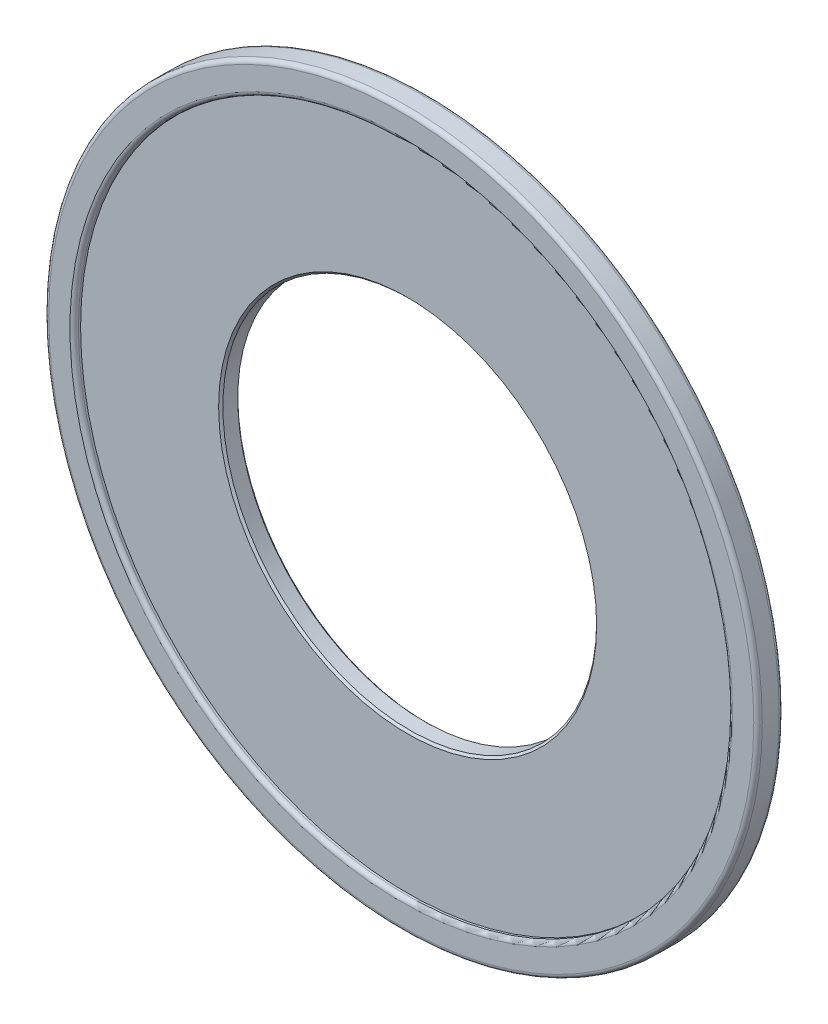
ISO-10303-21;
HEADER;
FILE_DESCRIPTION(('STEP AP214'),'2;1');
FILE_NAME('part.step','',(''),(''),'','','');
FILE_SCHEMA(('AUTOMOTIVE_DESIGN { 1 0 10303 214 1 1 1 1 }'));
ENDSEC;
DATA;
#1=APPLICATION_CONTEXT('core data for automotive mechanical design processes');
#2=APPLICATION_PROTOCOL_DEFINITION('international standard','automotive_design',2000,#1);
#3=PRODUCT_CONTEXT('',#1,'mechanical');
#4=PRODUCT('Part','Part','',(#3));
#5=PRODUCT_RELATED_PRODUCT_CATEGORY('part','',(#4));
#6=PRODUCT_DEFINITION_FORMATION('','',#4);
#7=PRODUCT_DEFINITION_CONTEXT('part definition',#1,'design');
#8=PRODUCT_DEFINITION('design','',#6,#7);
#9=PRODUCT_DEFINITION_SHAPE('','',#8);
#10=(LENGTH_UNIT() NAMED_UNIT(*) SI_UNIT(.MILLI.,.METRE.));
#11=(NAMED_UNIT(*) PLANE_ANGLE_UNIT() SI_UNIT($,.RADIAN.));
#12=(NAMED_UNIT(*) SI_UNIT($,.STERADIAN.) SOLID_ANGLE_UNIT());
#13=UNCERTAINTY_MEASURE_WITH_UNIT(LENGTH_MEASURE(1.E-05),#10,'distance_accuracy_value','');
#14=(GEOMETRIC_REPRESENTATION_CONTEXT(3) GLOBAL_UNCERTAINTY_ASSIGNED_CONTEXT((#13)) GLOBAL_UNIT_ASSIGNED_CONTEXT((#10,
#11,#12)) REPRESENTATION_CONTEXT('',''));
#15=CARTESIAN_POINT('',(0.,0.,0.));
#16=DIRECTION('',(0.,0.,1.));
#17=DIRECTION('',(1.,0.,0.));
#18=AXIS2_PLACEMENT_3D('',#15,#16,#17);
#19=CARTESIAN_POINT('',(0.,0.,6.));
#20=DIRECTION('',(0.,0.,-1.));
#21=DIRECTION('',(-1.,0.,0.));
#22=AXIS2_PLACEMENT_3D('',#19,#20,#21);
#23=CYLINDRICAL_SURFACE('',#22,44.);
#24=CARTESIAN_POINT('',(0.,0.,3.99999999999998));
#25=DIRECTION('',(0.,0.,1.));
#26=DIRECTION('',(1.,0.,0.));
#27=AXIS2_PLACEMENT_3D('',#24,#25,#26);
#28=CIRCLE('',#27,44.);
#29=CARTESIAN_POINT('',(44.,0.,3.99999999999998));
#30=VERTEX_POINT('',#29);
#31=EDGE_CURVE('E40',#30,#30,#28,.T.);
#32=ORIENTED_EDGE('',*,*,#31,.T.);
#33=EDGE_LOOP('',(#32));
#34=FACE_BOUND('',#33,.T.);
#35=CARTESIAN_POINT('',(0.,0.,0.49999999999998));
#36=DIRECTION('',(0.,0.,1.));
#37=DIRECTION('',(1.,0.,0.));
#38=AXIS2_PLACEMENT_3D('',#35,#36,#37);
#39=CIRCLE('',#38,44.);
#40=CARTESIAN_POINT('',(44.,0.,0.49999999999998));
#41=VERTEX_POINT('',#40);
#42=EDGE_CURVE('E44',#41,#41,#39,.F.);
#43=ORIENTED_EDGE('',*,*,#42,.T.);
#44=EDGE_LOOP('',(#43));
#45=FACE_BOUND('',#44,.T.);
#46=ADVANCED_FACE('F29',(#34,#45),#23,.F.);
#47=CARTESIAN_POINT('',(0.,0.,6.));
#48=DIRECTION('',(0.,0.,1.));
#49=DIRECTION('',(1.,0.,0.));
#50=AXIS2_PLACEMENT_3D('',#47,#48,#49);
#51=PLANE('',#50);
#52=CARTESIAN_POINT('',(0.,0.,6.));
#53=DIRECTION('',(0.,0.,1.));
#54=DIRECTION('',(1.,0.,0.));
#55=AXIS2_PLACEMENT_3D('',#52,#53,#54);
#56=CIRCLE('',#55,83.);
#57=CARTESIAN_POINT('',(83.,0.,6.));
#58=VERTEX_POINT('',#57);
#59=EDGE_CURVE('E52',#58,#58,#56,.T.);
#60=ORIENTED_EDGE('',*,*,#59,.T.);
#61=EDGE_LOOP('',(#60));
#62=FACE_BOUND('',#61,.T.);
#63=CARTESIAN_POINT('',(0.,0.,6.));
#64=DIRECTION('',(0.,0.,1.));
#65=DIRECTION('',(1.,0.,0.));
#66=AXIS2_PLACEMENT_3D('',#63,#64,#65);
#67=CIRCLE('',#66,78.);
#68=CARTESIAN_POINT('',(78.,0.,6.));
#69=VERTEX_POINT('',#68);
#70=EDGE_CURVE('E55',#69,#69,#67,.F.);
#71=ORIENTED_EDGE('',*,*,#70,.T.);
#72=EDGE_LOOP('',(#71));
#73=FACE_BOUND('',#72,.T.);
#74=ADVANCED_FACE('F89',(#62,#73),#51,.T.);
#75=CARTESIAN_POINT('',(0.,0.,0.));
#76=DIRECTION('',(0.,0.,1.));
#77=DIRECTION('',(1.,0.,0.));
#78=AXIS2_PLACEMENT_3D('',#75,#76,#77);
#79=PLANE('',#78);
#80=CARTESIAN_POINT('',(0.,0.,0.));
#81=DIRECTION('',(0.,0.,1.));
#82=DIRECTION('',(1.,0.,0.));
#83=AXIS2_PLACEMENT_3D('',#80,#81,#82);
#84=CIRCLE('',#83,44.5);
#85=CARTESIAN_POINT('',(44.5,0.,0.));
#86=VERTEX_POINT('',#85);
#87=EDGE_CURVE('E10',#86,#86,#84,.T.);
#88=ORIENTED_EDGE('',*,*,#87,.T.);
#89=EDGE_LOOP('',(#88));
#90=FACE_BOUND('',#89,.T.);
#91=CARTESIAN_POINT('',(0.,0.,0.));
#92=DIRECTION('',(0.,0.,1.));
#93=DIRECTION('',(1.,0.,0.));
#94=AXIS2_PLACEMENT_3D('',#91,#92,#93);
#95=CIRCLE('',#94,83.);
#96=CARTESIAN_POINT('',(83.,0.,0.));
#97=VERTEX_POINT('',#96);
#98=EDGE_CURVE('E58',#97,#97,#95,.F.);
#99=ORIENTED_EDGE('',*,*,#98,.T.);
#100=EDGE_LOOP('',(#99));
#101=FACE_BOUND('',#100,.T.);
#102=ADVANCED_FACE('F84',(#90,#101),#79,.F.);
#103=CARTESIAN_POINT('',(0.,0.,6.));
#104=DIRECTION('',(0.,0.,-1.));
#105=DIRECTION('',(-1.,0.,0.));
#106=AXIS2_PLACEMENT_3D('',#103,#104,#105);
#107=CYLINDRICAL_SURFACE('',#106,84.);
#108=CARTESIAN_POINT('',(0.,0.,1.));
#109=DIRECTION('',(0.,0.,1.));
#110=DIRECTION('',(1.,0.,0.));
#111=AXIS2_PLACEMENT_3D('',#108,#109,#110);
#112=CIRCLE('',#111,84.);
#113=CARTESIAN_POINT('',(84.,0.,1.));
#114=VERTEX_POINT('',#113);
#115=EDGE_CURVE('E61',#114,#114,#112,.T.);
#116=ORIENTED_EDGE('',*,*,#115,.T.);
#117=EDGE_LOOP('',(#116));
#118=FACE_BOUND('',#117,.T.);
#119=CARTESIAN_POINT('',(0.,0.,5.));
#120=DIRECTION('',(0.,0.,1.));
#121=DIRECTION('',(1.,0.,0.));
#122=AXIS2_PLACEMENT_3D('',#119,#120,#121);
#123=CIRCLE('',#122,84.);
#124=CARTESIAN_POINT('',(84.,0.,5.));
#125=VERTEX_POINT('',#124);
#126=EDGE_CURVE('E64',#125,#125,#123,.F.);
#127=ORIENTED_EDGE('',*,*,#126,.T.);
#128=EDGE_LOOP('',(#127));
#129=FACE_BOUND('',#128,.T.);
#130=ADVANCED_FACE('F75',(#118,#129),#107,.T.);
#131=CARTESIAN_POINT('',(0.,0.,4.5));
#132=DIRECTION('',(0.,0.,1.));
#133=DIRECTION('',(1.,0.,0.));
#134=AXIS2_PLACEMENT_3D('',#131,#132,#133);
#135=CYLINDRICAL_SURFACE('',#134,77.);
#136=CARTESIAN_POINT('',(0.,0.,5.));
#137=DIRECTION('',(0.,0.,1.));
#138=DIRECTION('',(1.,0.,0.));
#139=AXIS2_PLACEMENT_3D('',#136,#137,#138);
#140=CIRCLE('',#139,77.);
#141=CARTESIAN_POINT('',(77.,0.,5.));
#142=VERTEX_POINT('',#141);
#143=EDGE_CURVE('E49',#142,#142,#140,.T.);
#144=ORIENTED_EDGE('',*,*,#143,.T.);
#145=EDGE_LOOP('',(#144));
#146=FACE_BOUND('',#145,.T.);
#147=CARTESIAN_POINT('',(0.,0.,4.5));
#148=DIRECTION('',(0.,0.,1.));
#149=DIRECTION('',(1.,0.,0.));
#150=AXIS2_PLACEMENT_3D('',#147,#148,#149);
#151=CIRCLE('',#150,77.);
#152=CARTESIAN_POINT('',(77.,0.,4.5));
#153=VERTEX_POINT('',#152);
#154=EDGE_CURVE('E67',#153,#153,#151,.T.);
#155=ORIENTED_EDGE('',*,*,#154,.F.);
#156=EDGE_LOOP('',(#155));
#157=FACE_BOUND('',#156,.T.);
#158=ADVANCED_FACE('F73',(#146,#157),#135,.F.);
#159=CARTESIAN_POINT('',(0.,0.,4.5));
#160=DIRECTION('',(0.,0.,1.));
#161=DIRECTION('',(1.,0.,0.));
#162=AXIS2_PLACEMENT_3D('',#159,#160,#161);
#163=PLANE('',#162);
#164=CARTESIAN_POINT('',(0.,0.,4.5));
#165=DIRECTION('',(0.,0.,1.));
#166=DIRECTION('',(1.,0.,0.));
#167=AXIS2_PLACEMENT_3D('',#164,#165,#166);
#168=CIRCLE('',#167,44.5);
#169=CARTESIAN_POINT('',(44.5,0.,4.5));
#170=VERTEX_POINT('',#169);
#171=EDGE_CURVE('E36',#170,#170,#168,.F.);
#172=ORIENTED_EDGE('',*,*,#171,.T.);
#173=EDGE_LOOP('',(#172));
#174=FACE_BOUND('',#173,.T.);
#175=ORIENTED_EDGE('',*,*,#154,.T.);
#176=EDGE_LOOP('',(#175));
#177=FACE_BOUND('',#176,.T.);
#178=ADVANCED_FACE('F71',(#174,#177),#163,.T.);
#179=CARTESIAN_POINT('',(0.,0.,1.));
#180=DIRECTION('',(0.,0.,1.));
#181=DIRECTION('',(1.,0.,0.));
#182=AXIS2_PLACEMENT_3D('',#179,#180,#181);
#183=TOROIDAL_SURFACE('',#182,83.,1.);
#184=ORIENTED_EDGE('',*,*,#98,.F.);
#185=EDGE_LOOP('',(#184));
#186=FACE_BOUND('',#185,.T.);
#187=ORIENTED_EDGE('',*,*,#115,.F.);
#188=EDGE_LOOP('',(#187));
#189=FACE_BOUND('',#188,.T.);
#190=ADVANCED_FACE('F82',(#186,#189),#183,.T.);
#191=CARTESIAN_POINT('',(0.,0.,5.));
#192=DIRECTION('',(0.,0.,1.));
#193=DIRECTION('',(1.,0.,0.));
#194=AXIS2_PLACEMENT_3D('',#191,#192,#193);
#195=TOROIDAL_SURFACE('',#194,83.,1.);
#196=ORIENTED_EDGE('',*,*,#126,.F.);
#197=EDGE_LOOP('',(#196));
#198=FACE_BOUND('',#197,.T.);
#199=ORIENTED_EDGE('',*,*,#59,.F.);
#200=EDGE_LOOP('',(#199));
#201=FACE_BOUND('',#200,.T.);
#202=ADVANCED_FACE('F102',(#198,#201),#195,.T.);
#203=CARTESIAN_POINT('',(0.,0.,5.));
#204=DIRECTION('',(0.,0.,1.));
#205=DIRECTION('',(1.,0.,0.));
#206=AXIS2_PLACEMENT_3D('',#203,#204,#205);
#207=TOROIDAL_SURFACE('',#206,78.,1.);
#208=ORIENTED_EDGE('',*,*,#70,.F.);
#209=EDGE_LOOP('',(#208));
#210=FACE_BOUND('',#209,.T.);
#211=ORIENTED_EDGE('',*,*,#143,.F.);
#212=EDGE_LOOP('',(#211));
#213=FACE_BOUND('',#212,.T.);
#214=ADVANCED_FACE('F106',(#210,#213),#207,.T.);
#215=CARTESIAN_POINT('',(0.,0.,3.99999999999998));
#216=DIRECTION('',(0.,0.,1.));
#217=DIRECTION('',(1.,0.,0.));
#218=AXIS2_PLACEMENT_3D('',#215,#216,#217);
#219=CONICAL_SURFACE('',#218,44.,0.785398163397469);
#220=ORIENTED_EDGE('',*,*,#171,.F.);
#221=EDGE_LOOP('',(#220));
#222=FACE_BOUND('',#221,.T.);
#223=ORIENTED_EDGE('',*,*,#31,.F.);
#224=EDGE_LOOP('',(#223));
#225=FACE_BOUND('',#224,.T.);
#226=ADVANCED_FACE('F109',(#222,#225),#219,.F.);
#227=CARTESIAN_POINT('',(0.,0.,0.));
#228=DIRECTION('',(0.,0.,-1.));
#229=DIRECTION('',(-1.,0.,0.));
#230=AXIS2_PLACEMENT_3D('',#227,#228,#229);
#231=CONICAL_SURFACE('',#230,44.5,0.785398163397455);
#232=ORIENTED_EDGE('',*,*,#42,.F.);
#233=EDGE_LOOP('',(#232));
#234=FACE_BOUND('',#233,.T.);
#235=ORIENTED_EDGE('',*,*,#87,.F.);
#236=EDGE_LOOP('',(#235));
#237=FACE_BOUND('',#236,.T.);
#238=ADVANCED_FACE('F31',(#234,#237),#231,.F.);
#239=CLOSED_SHELL('',(#46,#74,#102,#130,#158,#178,#190,#202,#214,#226,#238));
#240=MANIFOLD_SOLID_BREP('B2',#239);
#241=ADVANCED_BREP_SHAPE_REPRESENTATION('',(#18,#240),#14);
#242=SHAPE_DEFINITION_REPRESENTATION(#9,#241);
ENDSEC;
END-ISO-10303-21;
